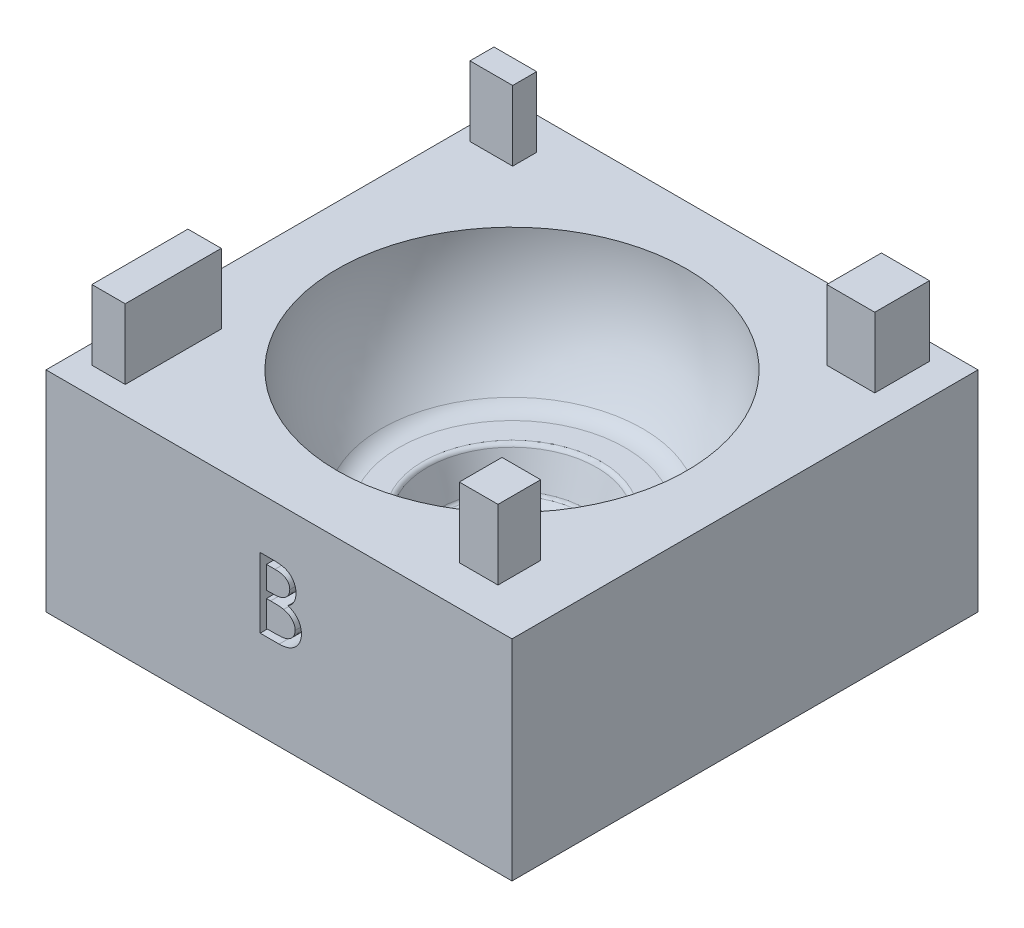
from build123d import *

# Parameters (mm, degrees)
FILLET1_R           = 1
FILLET2_R           = 5
SKETCH3_W           = 100
SKETCH3_H           = 100
BOSS_EXTRUDE1_DEPTH = 45
SKETCH5_W           = 9.158381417
SKETCH5_H           = 5.151589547
SKETCH5_W_2         = 10.303179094
SKETCH5_H_2         = 11.734176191
SKETCH5_W_3         = 7.154985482
SKETCH5_H_3         = 20.606358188
SKETCH5_W_4         = 8.29978316
SKETCH5_H_4         = 9.158381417
BOSS_EXTRUDE2_DEPTH = 15
CUT_EXTRUDE1_DEPTH  = 5


with BuildPart() as part:
    # Sketch1 → Revolve1 (revolve)
    with BuildSketch(Plane.XY):
        with BuildLine():
            ThreePointArc((26.438477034, 26.594302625), (37.5, 0), (26.438477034, -26.594302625))
            Line((26.438477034, -26.594302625), (18.438477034, -26.594302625))
            Line((18.438477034, -26.594302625), (15.632766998, -34.08616429))
            ThreePointArc((15.632766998, -34.08616429), (11.926184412, -35.553004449), (8.084838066, -36.618101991))
            Line((8.084838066, -36.618101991), (4.436473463, -26.594302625))
            Line((4.436473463, -26.594302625), (0, -26.594302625))
            Line((0, -26.594302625), (0, 26.594302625))
            Line((0, 26.594302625), (4.436473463, 26.594302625))
            Line((4.436473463, 26.594302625), (8.084838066, 36.618101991))
            ThreePointArc((8.084838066, 36.618101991), (11.926184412, 35.553004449), (15.632766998, 34.08616429))
            Line((15.632766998, 34.08616429), (18.438477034, 26.594302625))
            Line((18.438477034, 26.594302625), (26.438477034, 26.594302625))
        make_face()
    revolve(axis=Axis((0, 26.594302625, 0), (0, -1, 0)))

    # Fillet1
    fillet1_edges = [part.edges().sort_by_distance(p)[0] for p in [
        (-18.438477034, -26.594302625, 0),
        (-15.632766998, -34.08616429, 0),
        (-8.084838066, -36.618101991, 0),
        (-4.436473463, -26.594302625, 0),
        (-4.436473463, 26.594302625, 0),
        (-8.084838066, 36.618101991, 0),
        (-15.632766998, 34.08616429, 0),
        (-18.438477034, 26.594302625, 0),
    ]]
    fillet(fillet1_edges, radius=FILLET1_R)

    # Fillet2
    fillet2_edges = [part.edges().sort_by_distance(p)[0] for p in [
        (-26.438477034, -26.594302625, 0),
        (-26.438477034, 26.594302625, 0),
    ]]
    fillet(fillet2_edges, radius=FILLET2_R)


with BuildPart() as body_2:
    # Sketch3 → Boss-Extrude1 (new body)
    with BuildSketch(Plane(origin=(0, 0, 0), x_dir=(1, 0, 0), z_dir=(0, 1, 0))):
        Rectangle(SKETCH3_W, SKETCH3_H)
    extrude(amount=-BOSS_EXTRUDE1_DEPTH)

    # Sketch5 → Boss-Extrude2 (add)
    with BuildSketch(Plane(origin=(0, 0, 0), x_dir=(1, 0, 0), z_dir=(0, 1, 0))):
        with Locations((-42.357514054, 40.497217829)):
            Rectangle(SKETCH5_W, SKETCH5_H)
        with Locations((38.064522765, 40.497217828)):
            Rectangle(SKETCH5_W_2, SKETCH5_H_2)
        with Locations((-42.357514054, -33.914631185)):
            Rectangle(SKETCH5_W_3, SKETCH5_H_3)
        with Locations((34.343930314, -36.919725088)):
            Rectangle(SKETCH5_W_4, SKETCH5_H_4)
    extrude(amount=BOSS_EXTRUDE2_DEPTH)

    # Sketch6 → Cut-Extrude1 (cut)
    with BuildSketch(Plane.XY.offset(50)):
        with BuildLine():
            Line((-4.038461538, -10.955866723), (-1.111778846, -10.955866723))
            add(Edge.make_bspline(
                [(-1.111778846, -10.955866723), (-0.96851394, -10.956619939), (-0.690830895, -10.958079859), (-0.287033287, -10.980721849), (0.091175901, -11.01159472), (0.443906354, -11.060580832), (0.770995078, -11.119688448), (1.073427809, -11.19126766), (1.350242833, -11.277096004), (1.680725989, -11.413580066), (2.057528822, -11.616393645), (2.465521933, -11.916087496), (2.814397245, -12.282655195), (3.115195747, -12.696152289), (3.354343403, -13.151019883), (3.527354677, -13.636416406), (3.636888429, -14.146081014), (3.648153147, -14.495980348), (3.653846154, -14.672813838)],
                knots=[0, 0, 0, 0, 1.001505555, 1.941167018, 2.826882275, 3.653841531, 4.429895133, 5.150066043, 5.825578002, 6.45369114, 7.647487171, 8.808567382, 9.977351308, 11.170798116, 12.373658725, 13.556498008, 14.765093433, 16, 16, 16, 16], degree=3))
            add(Edge.make_bspline(
                [(3.653846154, -14.672813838), (3.649160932, -14.838467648), (3.639954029, -15.163993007), (3.551913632, -15.640110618), (3.414082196, -16.093330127), (3.222488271, -16.521997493), (2.973479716, -16.916427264), (2.678372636, -17.279801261), (2.322329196, -17.596734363), (2.055572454, -17.773918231), (1.920072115, -17.863919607)],
                knots=[0, 0, 0, 0, 1.044552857, 2.05264487, 3.044412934, 4.028983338, 5.005914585, 5.980388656, 6.974128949, 8, 8, 8, 8], degree=3))
            add(Edge.make_bspline(
                [(1.920072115, -17.863919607), (2.090473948, -17.929341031), (2.416494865, -18.054508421), (2.865149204, -18.275803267), (3.25169854, -18.516498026), (3.57911488, -18.779348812), (3.859133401, -19.062672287), (4.103646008, -19.370622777), (4.312280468, -19.707217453), (4.491050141, -20.068946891), (4.63054481, -20.452117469), (4.735012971, -20.853135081), (4.794873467, -21.270561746), (4.80339193, -21.554641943), (4.807692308, -21.698054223)],
                knots=[0, 0, 0, 0, 1.27268992, 2.434971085, 3.483601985, 4.442670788, 5.356604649, 6.2567628, 7.179492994, 8.113709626, 9.066344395, 10.018646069, 10.999752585, 12, 12, 12, 12], degree=3))
            add(Edge.make_bspline(
                [(4.807692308, -21.698054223), (4.803505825, -21.844483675), (4.795268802, -22.132587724), (4.734497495, -22.555824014), (4.631601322, -22.960288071), (4.489867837, -23.348595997), (4.304886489, -23.719996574), (4.079766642, -24.074910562), (3.811345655, -24.409771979), (3.511076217, -24.728301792), (3.171381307, -25.014706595), (2.804885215, -25.26977391), (2.406972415, -25.479542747), (1.984178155, -25.655754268), (1.531759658, -25.790356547), (1.051748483, -25.884524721), (0.544558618, -25.947974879), (0.196516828, -25.953191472), (0.018028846, -25.955866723)],
                knots=[0, 0, 0, 0, 0.978564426, 1.925352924, 2.850884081, 3.763762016, 4.682927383, 5.618979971, 6.567305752, 7.547517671, 8.540179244, 9.531824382, 10.526200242, 11.540722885, 12.589160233, 13.674978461, 14.80764778, 16, 16, 16, 16], degree=3))
            Line((0.018028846, -25.955866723), (-4.038461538, -25.955866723))
            Line((-4.038461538, -25.955866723), (-4.038461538, -10.955866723))
        make_face()
        with BuildLine():
            Line((-2.692307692, -12.494328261), (-2.692307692, -17.302020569))
            Line((-2.692307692, -17.302020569), (-1.787860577, -17.302020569))
            add(Edge.make_bspline(
                [(-1.787860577, -17.302020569), (-1.655651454, -17.300306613), (-1.400196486, -17.296994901), (-1.030254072, -17.2875084), (-0.686861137, -17.260945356), (-0.370610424, -17.234389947), (-0.081999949, -17.191213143), (0.178330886, -17.139818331), (0.41446773, -17.085463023), (0.686780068, -16.993022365), (0.995664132, -16.856403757), (1.324948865, -16.644381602), (1.615239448, -16.39184866), (1.860370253, -16.100458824), (2.060990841, -15.779603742), (2.200335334, -15.434402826), (2.294823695, -15.073459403), (2.30335883, -14.825666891), (2.307692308, -14.699857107)],
                knots=[0, 0, 0, 0, 1.156816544, 2.235205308, 3.236616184, 4.169592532, 5.011045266, 5.787822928, 6.49130361, 7.128639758, 8.301311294, 9.436451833, 10.541879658, 11.654887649, 12.756523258, 13.837046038, 14.901820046, 16, 16, 16, 16], degree=3))
            add(Edge.make_bspline(
                [(2.307692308, -14.699857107), (2.30543725, -14.616603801), (2.301013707, -14.453293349), (2.264785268, -14.215224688), (2.203209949, -13.991322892), (2.12412012, -13.778519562), (2.013597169, -13.583468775), (1.88346804, -13.399426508), (1.726243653, -13.232660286), (1.547283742, -13.076791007), (1.341532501, -12.938600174), (1.109112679, -12.817568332), (0.846879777, -12.72010786), (0.559253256, -12.634752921), (0.241805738, -12.57480309), (-0.101799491, -12.52486), (-0.474376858, -12.499433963), (-0.732141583, -12.496068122), (-0.865384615, -12.494328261)],
                knots=[0, 0, 0, 0, 0.91205012, 1.789085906, 2.630437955, 3.453916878, 4.269457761, 5.079663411, 5.91843418, 6.774407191, 7.675494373, 8.627863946, 9.638891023, 10.736472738, 11.911756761, 13.175263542, 14.539845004, 16, 16, 16, 16], degree=3))
            Line((-0.865384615, -12.494328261), (-2.692307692, -12.494328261))
        make_face(mode=Mode.SUBTRACT)
        with BuildLine():
            Line((-2.692307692, -18.840482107), (-2.692307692, -24.417405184))
            Line((-2.692307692, -24.417405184), (-0.775240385, -24.417405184))
            add(Edge.make_bspline(
                [(-0.775240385, -24.417405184), (-0.638016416, -24.415760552), (-0.373535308, -24.412590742), (0.008327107, -24.402242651), (0.362254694, -24.378704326), (0.686632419, -24.341650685), (0.98496293, -24.301457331), (1.253667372, -24.247408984), (1.494923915, -24.185484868), (1.774670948, -24.089766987), (2.089685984, -23.941067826), (2.429161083, -23.716863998), (2.730987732, -23.449764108), (2.987295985, -23.140631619), (3.197351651, -22.80449736), (3.350160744, -22.448160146), (3.444407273, -22.077507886), (3.45581657, -21.824793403), (3.461538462, -21.698054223)],
                knots=[0, 0, 0, 0, 1.160039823, 2.235823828, 3.228722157, 4.157150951, 4.99529583, 5.772374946, 6.472645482, 7.099169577, 8.269452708, 9.405989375, 10.527446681, 11.663510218, 12.788923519, 13.866172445, 14.929861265, 16, 16, 16, 16], degree=3))
            add(Edge.make_bspline(
                [(3.461538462, -21.698054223), (3.460355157, -21.618797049), (3.458007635, -21.461561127), (3.422605, -21.23049333), (3.371116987, -21.006668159), (3.304553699, -20.789477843), (3.207613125, -20.582849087), (3.094442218, -20.38269526), (2.961750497, -20.188751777), (2.754989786, -19.943556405), (2.454252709, -19.661054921), (2.026937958, -19.384465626), (1.54105668, -19.161403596), (1.18865314, -19.066691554), (1.006610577, -19.017765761)],
                knots=[0, 0, 0, 0, 0.723448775, 1.435228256, 2.130040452, 2.821711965, 3.505591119, 4.210454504, 4.921174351, 5.648778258, 7.137944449, 8.670945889, 10.280296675, 12, 12, 12, 12], degree=3))
            add(Edge.make_bspline(
                [(1.006610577, -19.017765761), (0.933628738, -19.002958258), (0.775389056, -18.970852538), (0.517356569, -18.936962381), (0.222774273, -18.906769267), (-0.109038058, -18.884435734), (-0.478500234, -18.861350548), (-0.886401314, -18.852372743), (-1.33107552, -18.841661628), (-1.639614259, -18.840885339), (-1.799879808, -18.840482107)],
                knots=[0, 0, 0, 0, 0.634451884, 1.375622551, 2.216452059, 3.157844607, 4.20941857, 5.370758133, 6.634282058, 8, 8, 8, 8], degree=3))
            Line((-1.799879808, -18.840482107), (-2.692307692, -18.840482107))
        make_face(mode=Mode.SUBTRACT)
    extrude(amount=-CUT_EXTRUDE1_DEPTH, mode=Mode.SUBTRACT)

    # Combine1: cut part
    add(part.part, mode=Mode.SUBTRACT)


solid = body_2.part
